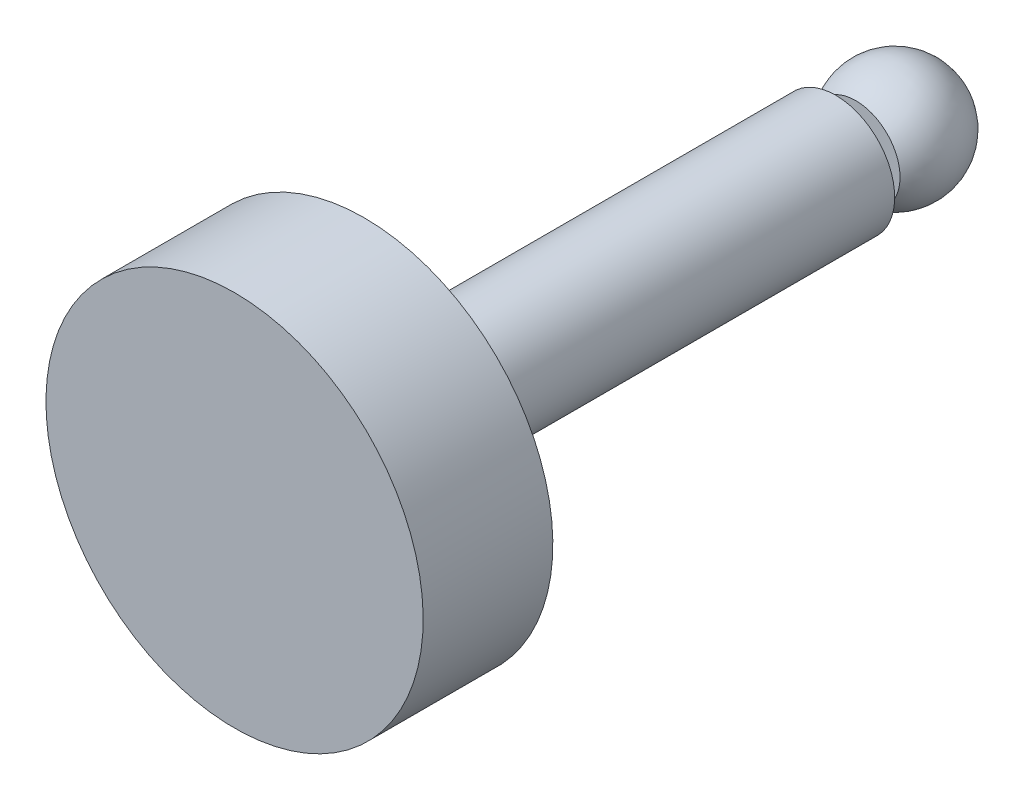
ISO-10303-21;
HEADER;
FILE_DESCRIPTION(('STEP AP214'),'2;1');
FILE_NAME('part.step','',(''),(''),'','','');
FILE_SCHEMA(('AUTOMOTIVE_DESIGN { 1 0 10303 214 1 1 1 1 }'));
ENDSEC;
DATA;
#1=APPLICATION_CONTEXT('core data for automotive mechanical design processes');
#2=APPLICATION_PROTOCOL_DEFINITION('international standard','automotive_design',2000,#1);
#3=PRODUCT_CONTEXT('',#1,'mechanical');
#4=PRODUCT('Part','Part','',(#3));
#5=PRODUCT_RELATED_PRODUCT_CATEGORY('part','',(#4));
#6=PRODUCT_DEFINITION_FORMATION('','',#4);
#7=PRODUCT_DEFINITION_CONTEXT('part definition',#1,'design');
#8=PRODUCT_DEFINITION('design','',#6,#7);
#9=PRODUCT_DEFINITION_SHAPE('','',#8);
#10=(LENGTH_UNIT() NAMED_UNIT(*) SI_UNIT(.MILLI.,.METRE.));
#11=(NAMED_UNIT(*) PLANE_ANGLE_UNIT() SI_UNIT($,.RADIAN.));
#12=(NAMED_UNIT(*) SI_UNIT($,.STERADIAN.) SOLID_ANGLE_UNIT());
#13=UNCERTAINTY_MEASURE_WITH_UNIT(LENGTH_MEASURE(1.E-05),#10,'distance_accuracy_value','');
#14=(GEOMETRIC_REPRESENTATION_CONTEXT(3) GLOBAL_UNCERTAINTY_ASSIGNED_CONTEXT((#13)) GLOBAL_UNIT_ASSIGNED_CONTEXT((#10,
#11,#12)) REPRESENTATION_CONTEXT('',''));
#15=CARTESIAN_POINT('',(0.,0.,0.));
#16=DIRECTION('',(0.,0.,1.));
#17=DIRECTION('',(1.,0.,0.));
#18=AXIS2_PLACEMENT_3D('',#15,#16,#17);
#19=CARTESIAN_POINT('',(0.,0.,8.3));
#20=DIRECTION('',(0.,0.,1.));
#21=DIRECTION('',(0.,1.,0.));
#22=AXIS2_PLACEMENT_3D('',#19,#20,#21);
#23=CYLINDRICAL_SURFACE('',#22,16.);
#24=CARTESIAN_POINT('',(0.,0.,61.));
#25=DIRECTION('',(0.,0.,1.));
#26=DIRECTION('',(0.,1.,0.));
#27=AXIS2_PLACEMENT_3D('',#24,#25,#26);
#28=CIRCLE('',#27,16.);
#29=CARTESIAN_POINT('',(0.,16.,61.));
#30=VERTEX_POINT('',#29);
#31=EDGE_CURVE('E8',#30,#30,#28,.T.);
#32=ORIENTED_EDGE('',*,*,#31,.F.);
#33=EDGE_LOOP('',(#32));
#34=FACE_BOUND('',#33,.T.);
#35=CARTESIAN_POINT('',(0.,0.,50.));
#36=DIRECTION('',(0.,0.,1.));
#37=DIRECTION('',(0.,1.,0.));
#38=AXIS2_PLACEMENT_3D('',#35,#36,#37);
#39=CIRCLE('',#38,16.);
#40=CARTESIAN_POINT('',(0.,16.,50.));
#41=VERTEX_POINT('',#40);
#42=EDGE_CURVE('E37',#41,#41,#39,.T.);
#43=ORIENTED_EDGE('',*,*,#42,.T.);
#44=EDGE_LOOP('',(#43));
#45=FACE_BOUND('',#44,.T.);
#46=ADVANCED_FACE('F12',(#34,#45),#23,.T.);
#47=CARTESIAN_POINT('',(0.,-16.,61.));
#48=DIRECTION('',(0.,0.,-1.));
#49=DIRECTION('',(0.,-1.,0.));
#50=AXIS2_PLACEMENT_3D('',#47,#48,#49);
#51=PLANE('',#50);
#52=ORIENTED_EDGE('',*,*,#31,.T.);
#53=EDGE_LOOP('',(#52));
#54=FACE_BOUND('',#53,.T.);
#55=ADVANCED_FACE('F61',(#54),#51,.F.);
#56=CARTESIAN_POINT('',(0.,0.,5.));
#57=DIRECTION('',(0.,-1.,0.));
#58=DIRECTION('',(-1.,0.,0.));
#59=AXIS2_PLACEMENT_3D('',#56,#57,#58);
#60=SPHERICAL_SURFACE('',#59,5.);
#61=CARTESIAN_POINT('',(0.,0.,5.));
#62=DIRECTION('',(0.,0.,1.));
#63=DIRECTION('',(0.,1.,0.));
#64=AXIS2_PLACEMENT_3D('',#61,#62,#63);
#65=SPHERICAL_SURFACE('',#64,5.);
#66=CARTESIAN_POINT('',(0.,0.,8.3));
#67=DIRECTION('',(0.,0.,1.));
#68=DIRECTION('',(0.,1.,0.));
#69=AXIS2_PLACEMENT_3D('',#66,#67,#68);
#70=CIRCLE('',#69,3.75632799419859);
#71=CARTESIAN_POINT('',(0.,3.75632799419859,8.3));
#72=VERTEX_POINT('',#71);
#73=EDGE_CURVE('E18',#72,#72,#70,.T.);
#74=ORIENTED_EDGE('',*,*,#73,.F.);
#75=EDGE_LOOP('',(#74));
#76=FACE_BOUND('',#75,.T.);
#77=ADVANCED_FACE('F66',(#76),#65,.T.);
#78=CARTESIAN_POINT('',(0.,-3.75632799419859,8.3));
#79=DIRECTION('',(0.,0.,-1.));
#80=DIRECTION('',(0.,-1.,0.));
#81=AXIS2_PLACEMENT_3D('',#78,#79,#80);
#82=PLANE('',#81);
#83=CARTESIAN_POINT('',(0.,0.,8.3));
#84=DIRECTION('',(0.,0.,1.));
#85=DIRECTION('',(0.,1.,0.));
#86=AXIS2_PLACEMENT_3D('',#83,#84,#85);
#87=CIRCLE('',#86,2.5);
#88=CARTESIAN_POINT('',(0.,2.5,8.3));
#89=VERTEX_POINT('',#88);
#90=EDGE_CURVE('E22',#89,#89,#87,.T.);
#91=ORIENTED_EDGE('',*,*,#90,.F.);
#92=EDGE_LOOP('',(#91));
#93=FACE_BOUND('',#92,.T.);
#94=ORIENTED_EDGE('',*,*,#73,.T.);
#95=EDGE_LOOP('',(#94));
#96=FACE_BOUND('',#95,.T.);
#97=ADVANCED_FACE('F70',(#93,#96),#82,.F.);
#98=CARTESIAN_POINT('',(0.,0.,8.3));
#99=DIRECTION('',(0.,0.,1.));
#100=DIRECTION('',(0.,1.,0.));
#101=AXIS2_PLACEMENT_3D('',#98,#99,#100);
#102=CYLINDRICAL_SURFACE('',#101,2.5);
#103=ORIENTED_EDGE('',*,*,#90,.T.);
#104=EDGE_LOOP('',(#103));
#105=FACE_BOUND('',#104,.T.);
#106=CARTESIAN_POINT('',(0.,0.,10.));
#107=DIRECTION('',(0.,0.,1.));
#108=DIRECTION('',(0.,1.,0.));
#109=AXIS2_PLACEMENT_3D('',#106,#107,#108);
#110=CIRCLE('',#109,2.5);
#111=CARTESIAN_POINT('',(0.,2.5,10.));
#112=VERTEX_POINT('',#111);
#113=EDGE_CURVE('E26',#112,#112,#110,.T.);
#114=ORIENTED_EDGE('',*,*,#113,.F.);
#115=EDGE_LOOP('',(#114));
#116=FACE_BOUND('',#115,.T.);
#117=ADVANCED_FACE('F57',(#105,#116),#102,.T.);
#118=CARTESIAN_POINT('',(0.,-5.,10.));
#119=DIRECTION('',(0.,0.,-1.));
#120=DIRECTION('',(0.,-1.,0.));
#121=AXIS2_PLACEMENT_3D('',#118,#119,#120);
#122=PLANE('',#121);
#123=ORIENTED_EDGE('',*,*,#113,.T.);
#124=EDGE_LOOP('',(#123));
#125=FACE_BOUND('',#124,.T.);
#126=CARTESIAN_POINT('',(0.,0.,10.));
#127=DIRECTION('',(0.,0.,1.));
#128=DIRECTION('',(0.,1.,0.));
#129=AXIS2_PLACEMENT_3D('',#126,#127,#128);
#130=CIRCLE('',#129,5.);
#131=CARTESIAN_POINT('',(0.,5.,10.));
#132=VERTEX_POINT('',#131);
#133=EDGE_CURVE('E31',#132,#132,#130,.T.);
#134=ORIENTED_EDGE('',*,*,#133,.F.);
#135=EDGE_LOOP('',(#134));
#136=FACE_BOUND('',#135,.T.);
#137=ADVANCED_FACE('F50',(#125,#136),#122,.T.);
#138=CARTESIAN_POINT('',(0.,0.,8.3));
#139=DIRECTION('',(0.,0.,1.));
#140=DIRECTION('',(0.,1.,0.));
#141=AXIS2_PLACEMENT_3D('',#138,#139,#140);
#142=CYLINDRICAL_SURFACE('',#141,5.);
#143=ORIENTED_EDGE('',*,*,#133,.T.);
#144=EDGE_LOOP('',(#143));
#145=FACE_BOUND('',#144,.T.);
#146=CARTESIAN_POINT('',(0.,0.,50.));
#147=DIRECTION('',(0.,0.,1.));
#148=DIRECTION('',(0.,1.,0.));
#149=AXIS2_PLACEMENT_3D('',#146,#147,#148);
#150=CIRCLE('',#149,5.);
#151=CARTESIAN_POINT('',(0.,5.,50.));
#152=VERTEX_POINT('',#151);
#153=EDGE_CURVE('E34',#152,#152,#150,.T.);
#154=ORIENTED_EDGE('',*,*,#153,.F.);
#155=EDGE_LOOP('',(#154));
#156=FACE_BOUND('',#155,.T.);
#157=ADVANCED_FACE('F45',(#145,#156),#142,.T.);
#158=CARTESIAN_POINT('',(0.,-5.,50.));
#159=DIRECTION('',(0.,0.,1.));
#160=DIRECTION('',(0.,1.,0.));
#161=AXIS2_PLACEMENT_3D('',#158,#159,#160);
#162=PLANE('',#161);
#163=ORIENTED_EDGE('',*,*,#42,.F.);
#164=EDGE_LOOP('',(#163));
#165=FACE_BOUND('',#164,.T.);
#166=ORIENTED_EDGE('',*,*,#153,.T.);
#167=EDGE_LOOP('',(#166));
#168=FACE_BOUND('',#167,.T.);
#169=ADVANCED_FACE('F42',(#165,#168),#162,.F.);
#170=CLOSED_SHELL('',(#46,#55,#77,#97,#117,#137,#157,#169));
#171=MANIFOLD_SOLID_BREP('B1',#170);
#172=ADVANCED_BREP_SHAPE_REPRESENTATION('',(#18,#171),#14);
#173=SHAPE_DEFINITION_REPRESENTATION(#9,#172);
ENDSEC;
END-ISO-10303-21;
